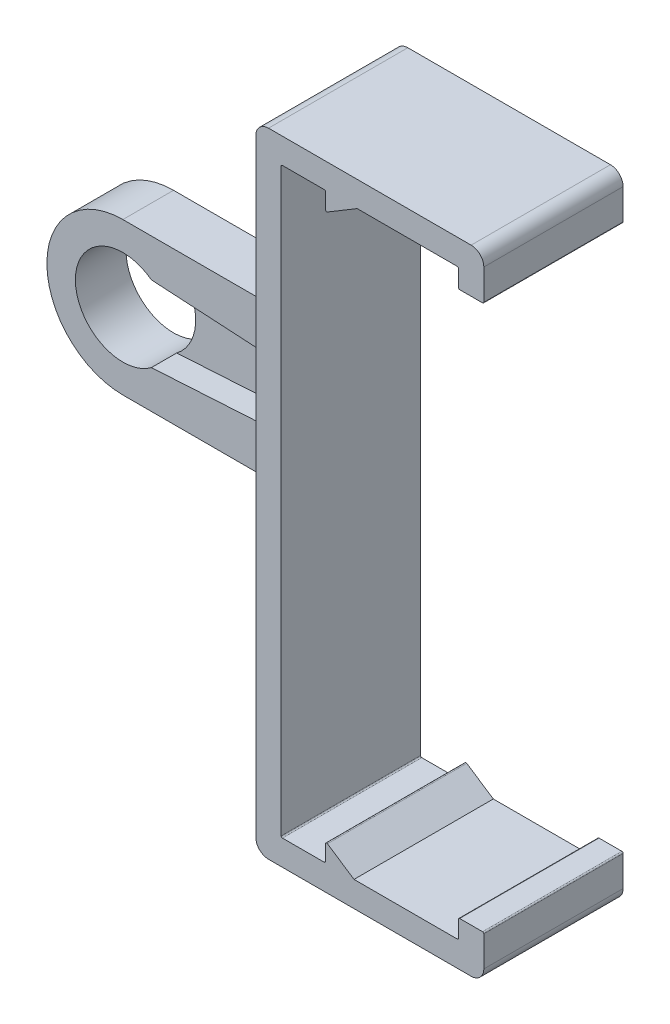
from build123d import *

# Parameters (mm, degrees)
SKETCH_1_R          = 3.75
EXTRUDE_1_DEPTH     = 4
CUT_EXTRUDE_START   = -2
CUT_EXTRUDE_1_DEPTH = 2
EXTRUDE_START       = -2.5
SKETCH_3_W          = 11
SKETCH_3_H          = 50
EXTRUDE_2_DEPTH     = 18
CUT_EXTRUDE_2_DEPTH = 27.5
CUT_EXTRUDE_3_DEPTH = 27.5
FILLET_1_R          = 0.1
FILLET_2_R          = 1


with BuildPart() as part:
    # Sketch 1 → Extrude 1 (new body)
    with BuildSketch(Plane.XY):
        with BuildLine():
            Line((36.58280714, -6.902337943), (36.58280714, -18.902337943))
            Line((36.58280714, -18.902337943), (16.58280714, -18.902337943))
            ThreePointArc((16.58280714, -18.902337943), (10.58280714, -12.902337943), (16.58280714, -6.902337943))
            Line((16.58280714, -6.902337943), (36.58280714, -6.902337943))
        make_face()
        with Locations((16.58280714, -12.902337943)):
            Circle(SKETCH_1_R, mode=Mode.SUBTRACT)
    extrude(amount=EXTRUDE_1_DEPTH)

    # Sketch 2 → Cut-Extrude 1 (cut)
    with BuildSketch(Plane.XY.offset(4).offset(CUT_EXTRUDE_START)):
        with BuildLine():
            Line((31.58280714, -15.152337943), (18.83280714, -15.902337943))
            ThreePointArc((18.83280714, -15.902337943), (12.83280714, -12.902337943), (18.83280714, -9.902337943))
            Line((18.83280714, -9.902337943), (31.58280714, -10.652337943))
            ThreePointArc((31.58280714, -10.652337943), (33.83280714, -12.902337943), (31.58280714, -15.152337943))
        make_face()
    extrude(amount=CUT_EXTRUDE_1_DEPTH, mode=Mode.SUBTRACT)

    # Sketch 3 → Extrude 2 (add)
    with BuildSketch(Plane(origin=(36.58280714, 0, 0), x_dir=(0, 0, -1), z_dir=(1, 0, 0)).offset(EXTRUDE_START)):
        with Locations((-5.5, -12.902337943)):
            Rectangle(SKETCH_3_W, SKETCH_3_H)
    extrude(amount=EXTRUDE_2_DEPTH)

    # Sketch 5 → Cut-Extrude 2 (cut)
    with BuildSketch(Plane.XY.offset(11)):
        Polygon((48.58280714, 8.597662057), (55.904505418, 8.597662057), (55.904505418, -34.402337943), (48.58280714, -34.402337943), (37.58280714, -34.402337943), (37.58280714, 8.597662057), align=None)
    extrude(amount=-CUT_EXTRUDE_2_DEPTH, mode=Mode.SUBTRACT)

    # Sketch 6 → Cut-Extrude 3 (cut)
    with BuildSketch(Plane.XY.offset(11)):
        Polygon((36.08280714, 10.097662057), (39.58280714, 10.097662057), (39.58280714, 8.597662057), (42.08280714, 10.097662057), (50.08280714, 10.097662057), (50.08280714, -35.902337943), (41.83280714, -35.902337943), (39.58280714, -34.407292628), (39.58280714, -35.902337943), (36.08280714, -35.902337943), align=None)
    extrude(amount=-CUT_EXTRUDE_3_DEPTH, mode=Mode.SUBTRACT)

    # Fillet 1
    fillet_1_edges = [part.edges().sort_by_distance(p)[0] for p in [
        (52.08280714, 8.597662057, 5.5),
        (52.08280714, -34.402337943, 5.5),
        (50.08280714, 8.597662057, 5.5),
        (36.08280714, -35.902337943, 5.5),
        (36.08280714, 10.097662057, 5.5),
        (50.08280714, -35.902337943, 5.5),
        (39.58280714, -34.407292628, 5.5),
        (39.58280714, -35.902337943, 5.5),
        (39.58280714, 10.097662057, 5.5),
        (39.58280714, 8.597662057, 5.5),
        (50.08280714, -34.402337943, 5.5),
        (50.08280714, 10.097662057, 5.5),
    ]]
    fillet(fillet_1_edges, radius=FILLET_1_R)

    # Fillet 2
    fillet_2_edges = [part.edges().sort_by_distance(p)[0] for p in [
        (34.08280714, -6.902337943, 2),
        (34.08280714, -37.902337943, 5.5),
        (34.08280714, 12.097662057, 5.5),
        (52.08280714, -37.902337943, 5.5),
        (52.08280714, 12.097662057, 5.5),
        (34.08280714, -18.902337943, 2),
    ]]
    fillet(fillet_2_edges, radius=FILLET_2_R)


solid = part.part
